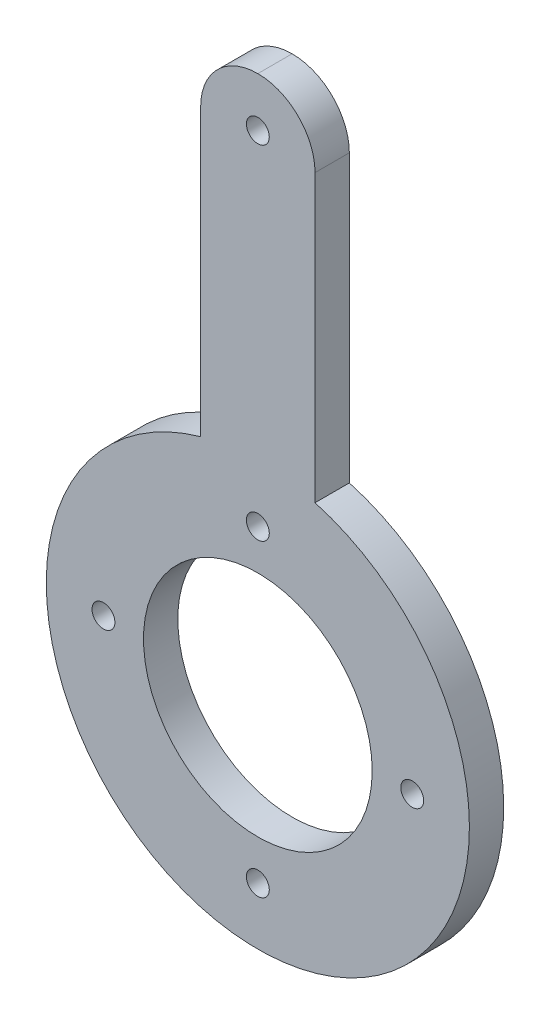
ISO-10303-21;
HEADER;
FILE_DESCRIPTION(('STEP AP214'),'2;1');
FILE_NAME('part.step','',(''),(''),'','','');
FILE_SCHEMA(('AUTOMOTIVE_DESIGN { 1 0 10303 214 1 1 1 1 }'));
ENDSEC;
DATA;
#1=APPLICATION_CONTEXT('core data for automotive mechanical design processes');
#2=APPLICATION_PROTOCOL_DEFINITION('international standard','automotive_design',2000,#1);
#3=PRODUCT_CONTEXT('',#1,'mechanical');
#4=PRODUCT('Part','Part','',(#3));
#5=PRODUCT_RELATED_PRODUCT_CATEGORY('part','',(#4));
#6=PRODUCT_DEFINITION_FORMATION('','',#4);
#7=PRODUCT_DEFINITION_CONTEXT('part definition',#1,'design');
#8=PRODUCT_DEFINITION('design','',#6,#7);
#9=PRODUCT_DEFINITION_SHAPE('','',#8);
#10=(LENGTH_UNIT() NAMED_UNIT(*) SI_UNIT(.MILLI.,.METRE.));
#11=(NAMED_UNIT(*) PLANE_ANGLE_UNIT() SI_UNIT($,.RADIAN.));
#12=(NAMED_UNIT(*) SI_UNIT($,.STERADIAN.) SOLID_ANGLE_UNIT());
#13=UNCERTAINTY_MEASURE_WITH_UNIT(LENGTH_MEASURE(1.E-05),#10,'distance_accuracy_value','');
#14=(GEOMETRIC_REPRESENTATION_CONTEXT(3) GLOBAL_UNCERTAINTY_ASSIGNED_CONTEXT((#13)) GLOBAL_UNIT_ASSIGNED_CONTEXT((#10,
#11,#12)) REPRESENTATION_CONTEXT('',''));
#15=CARTESIAN_POINT('',(0.,0.,0.));
#16=DIRECTION('',(0.,0.,1.));
#17=DIRECTION('',(1.,0.,0.));
#18=AXIS2_PLACEMENT_3D('',#15,#16,#17);
#19=CARTESIAN_POINT('',(0.,0.,3.));
#20=DIRECTION('',(0.,0.,1.));
#21=DIRECTION('',(1.,0.,0.));
#22=AXIS2_PLACEMENT_3D('',#19,#20,#21);
#23=PLANE('',#22);
#24=CARTESIAN_POINT('',(-13.4999999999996,-3.83693077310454E-13,3.));
#25=DIRECTION('',(0.,0.,1.));
#26=DIRECTION('',(1.,0.,0.));
#27=AXIS2_PLACEMENT_3D('',#24,#25,#26);
#28=CIRCLE('',#27,1.00000000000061);
#29=CARTESIAN_POINT('',(-12.499999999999,-3.83693077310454E-13,3.));
#30=VERTEX_POINT('',#29);
#31=EDGE_CURVE('E139',#30,#30,#28,.T.);
#32=ORIENTED_EDGE('',*,*,#31,.F.);
#33=EDGE_LOOP('',(#32));
#34=FACE_BOUND('',#33,.T.);
#35=CARTESIAN_POINT('',(13.5000000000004,3.82039804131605E-13,3.));
#36=DIRECTION('',(0.,0.,1.));
#37=DIRECTION('',(1.,0.,0.));
#38=AXIS2_PLACEMENT_3D('',#35,#36,#37);
#39=CIRCLE('',#38,1.0000000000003);
#40=CARTESIAN_POINT('',(14.5000000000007,3.82039804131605E-13,3.));
#41=VERTEX_POINT('',#40);
#42=EDGE_CURVE('E151',#41,#41,#39,.T.);
#43=ORIENTED_EDGE('',*,*,#42,.F.);
#44=EDGE_LOOP('',(#43));
#45=FACE_BOUND('',#44,.T.);
#46=CARTESIAN_POINT('',(0.,0.,3.));
#47=DIRECTION('',(0.,0.,1.));
#48=DIRECTION('',(1.,0.,0.));
#49=AXIS2_PLACEMENT_3D('',#46,#47,#48);
#50=CIRCLE('',#49,10.);
#51=CARTESIAN_POINT('',(10.,0.,3.));
#52=VERTEX_POINT('',#51);
#53=EDGE_CURVE('E120',#52,#52,#50,.T.);
#54=ORIENTED_EDGE('',*,*,#53,.F.);
#55=EDGE_LOOP('',(#54));
#56=FACE_BOUND('',#55,.T.);
#57=DIRECTION('',(0.,1.,0.));
#58=VECTOR('',#57,1.);
#59=CARTESIAN_POINT('',(5.,47.8115131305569,3.));
#60=LINE('',#59,#58);
#61=CARTESIAN_POINT('',(5.,17.8115131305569,3.));
#62=VERTEX_POINT('',#61);
#63=CARTESIAN_POINT('',(5.,42.8115131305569,3.));
#64=VERTEX_POINT('',#63);
#65=EDGE_CURVE('E91',#62,#64,#60,.T.);
#66=ORIENTED_EDGE('',*,*,#65,.T.);
#67=CARTESIAN_POINT('',(0.,42.8115131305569,3.));
#68=DIRECTION('',(0.,0.,1.));
#69=DIRECTION('',(1.,0.,0.));
#70=AXIS2_PLACEMENT_3D('',#67,#68,#69);
#71=CIRCLE('',#70,5.);
#72=CARTESIAN_POINT('',(0.,47.8115131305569,3.));
#73=VERTEX_POINT('',#72);
#74=EDGE_CURVE('E42',#64,#73,#71,.T.);
#75=ORIENTED_EDGE('',*,*,#74,.T.);
#76=CARTESIAN_POINT('',(0.,42.8115131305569,3.));
#77=DIRECTION('',(0.,0.,1.));
#78=DIRECTION('',(1.,0.,0.));
#79=AXIS2_PLACEMENT_3D('',#76,#77,#78);
#80=CIRCLE('',#79,5.);
#81=CARTESIAN_POINT('',(-5.,42.8115131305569,3.));
#82=VERTEX_POINT('',#81);
#83=EDGE_CURVE('E52',#73,#82,#80,.T.);
#84=ORIENTED_EDGE('',*,*,#83,.T.);
#85=DIRECTION('',(0.,-1.,0.));
#86=VECTOR('',#85,1.);
#87=CARTESIAN_POINT('',(-5.,47.8115131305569,3.));
#88=LINE('',#87,#86);
#89=CARTESIAN_POINT('',(-5.,17.8115131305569,3.));
#90=VERTEX_POINT('',#89);
#91=EDGE_CURVE('E74',#82,#90,#88,.T.);
#92=ORIENTED_EDGE('',*,*,#91,.T.);
#93=CARTESIAN_POINT('',(0.,0.,3.));
#94=DIRECTION('',(0.,0.,1.));
#95=DIRECTION('',(1.,0.,0.));
#96=AXIS2_PLACEMENT_3D('',#93,#94,#95);
#97=CIRCLE('',#96,18.5);
#98=EDGE_CURVE('E77',#90,#62,#97,.T.);
#99=ORIENTED_EDGE('',*,*,#98,.T.);
#100=EDGE_LOOP('',(#66,#75,#84,#92,#99));
#101=FACE_BOUND('',#100,.T.);
#102=CARTESIAN_POINT('',(0.,13.5,3.));
#103=DIRECTION('',(0.,0.,1.));
#104=DIRECTION('',(1.,0.,0.));
#105=AXIS2_PLACEMENT_3D('',#102,#103,#104);
#106=CIRCLE('',#105,1.);
#107=CARTESIAN_POINT('',(1.,13.5,3.));
#108=VERTEX_POINT('',#107);
#109=EDGE_CURVE('E157',#108,#108,#106,.T.);
#110=ORIENTED_EDGE('',*,*,#109,.F.);
#111=EDGE_LOOP('',(#110));
#112=FACE_BOUND('',#111,.T.);
#113=CARTESIAN_POINT('',(7.6407960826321E-13,-13.5,3.));
#114=DIRECTION('',(0.,0.,1.));
#115=DIRECTION('',(1.,0.,0.));
#116=AXIS2_PLACEMENT_3D('',#113,#114,#115);
#117=CIRCLE('',#116,1.00000000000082);
#118=CARTESIAN_POINT('',(1.00000000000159,-13.5,3.));
#119=VERTEX_POINT('',#118);
#120=EDGE_CURVE('E145',#119,#119,#117,.T.);
#121=ORIENTED_EDGE('',*,*,#120,.F.);
#122=EDGE_LOOP('',(#121));
#123=FACE_BOUND('',#122,.T.);
#124=CARTESIAN_POINT('',(0.,43.5,3.));
#125=DIRECTION('',(0.,0.,1.));
#126=DIRECTION('',(1.,0.,0.));
#127=AXIS2_PLACEMENT_3D('',#124,#125,#126);
#128=CIRCLE('',#127,1.);
#129=CARTESIAN_POINT('',(1.,43.5,3.));
#130=VERTEX_POINT('',#129);
#131=EDGE_CURVE('E131',#130,#130,#128,.T.);
#132=ORIENTED_EDGE('',*,*,#131,.F.);
#133=EDGE_LOOP('',(#132));
#134=FACE_BOUND('',#133,.T.);
#135=ADVANCED_FACE('F33',(#34,#45,#56,#101,#112,#123,#134),#23,.T.);
#136=CARTESIAN_POINT('',(0.,0.,0.));
#137=DIRECTION('',(0.,0.,1.));
#138=DIRECTION('',(1.,0.,0.));
#139=AXIS2_PLACEMENT_3D('',#136,#137,#138);
#140=PLANE('',#139);
#141=CARTESIAN_POINT('',(0.,42.8115131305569,0.));
#142=DIRECTION('',(0.,0.,1.));
#143=DIRECTION('',(1.,0.,0.));
#144=AXIS2_PLACEMENT_3D('',#141,#142,#143);
#145=CIRCLE('',#144,5.);
#146=CARTESIAN_POINT('',(-5.,42.8115131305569,0.));
#147=VERTEX_POINT('',#146);
#148=CARTESIAN_POINT('',(0.,47.8115131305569,0.));
#149=VERTEX_POINT('',#148);
#150=EDGE_CURVE('E97',#147,#149,#145,.F.);
#151=ORIENTED_EDGE('',*,*,#150,.T.);
#152=CARTESIAN_POINT('',(0.,42.8115131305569,0.));
#153=DIRECTION('',(0.,0.,1.));
#154=DIRECTION('',(1.,0.,0.));
#155=AXIS2_PLACEMENT_3D('',#152,#153,#154);
#156=CIRCLE('',#155,5.);
#157=CARTESIAN_POINT('',(5.,42.8115131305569,0.));
#158=VERTEX_POINT('',#157);
#159=EDGE_CURVE('E99',#149,#158,#156,.F.);
#160=ORIENTED_EDGE('',*,*,#159,.T.);
#161=DIRECTION('',(0.,1.,0.));
#162=VECTOR('',#161,1.);
#163=CARTESIAN_POINT('',(5.,47.8115131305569,0.));
#164=LINE('',#163,#162);
#165=CARTESIAN_POINT('',(5.,17.8115131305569,0.));
#166=VERTEX_POINT('',#165);
#167=EDGE_CURVE('E82',#166,#158,#164,.T.);
#168=ORIENTED_EDGE('',*,*,#167,.F.);
#169=CARTESIAN_POINT('',(0.,0.,0.));
#170=DIRECTION('',(0.,0.,1.));
#171=DIRECTION('',(1.,0.,0.));
#172=AXIS2_PLACEMENT_3D('',#169,#170,#171);
#173=CIRCLE('',#172,18.5);
#174=CARTESIAN_POINT('',(-5.,17.8115131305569,0.));
#175=VERTEX_POINT('',#174);
#176=EDGE_CURVE('E119',#175,#166,#173,.T.);
#177=ORIENTED_EDGE('',*,*,#176,.F.);
#178=DIRECTION('',(0.,-1.,0.));
#179=VECTOR('',#178,1.);
#180=CARTESIAN_POINT('',(-5.,47.8115131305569,0.));
#181=LINE('',#180,#179);
#182=EDGE_CURVE('E95',#147,#175,#181,.T.);
#183=ORIENTED_EDGE('',*,*,#182,.F.);
#184=EDGE_LOOP('',(#151,#160,#168,#177,#183));
#185=FACE_BOUND('',#184,.T.);
#186=CARTESIAN_POINT('',(0.,0.,0.));
#187=DIRECTION('',(0.,0.,1.));
#188=DIRECTION('',(1.,0.,0.));
#189=AXIS2_PLACEMENT_3D('',#186,#187,#188);
#190=CIRCLE('',#189,10.);
#191=CARTESIAN_POINT('',(10.,0.,0.));
#192=VERTEX_POINT('',#191);
#193=EDGE_CURVE('E160',#192,#192,#190,.T.);
#194=ORIENTED_EDGE('',*,*,#193,.T.);
#195=EDGE_LOOP('',(#194));
#196=FACE_BOUND('',#195,.T.);
#197=CARTESIAN_POINT('',(0.,13.5,0.));
#198=DIRECTION('',(0.,0.,1.));
#199=DIRECTION('',(1.,0.,0.));
#200=AXIS2_PLACEMENT_3D('',#197,#198,#199);
#201=CIRCLE('',#200,1.);
#202=CARTESIAN_POINT('',(1.,13.5,0.));
#203=VERTEX_POINT('',#202);
#204=EDGE_CURVE('E154',#203,#203,#201,.T.);
#205=ORIENTED_EDGE('',*,*,#204,.T.);
#206=EDGE_LOOP('',(#205));
#207=FACE_BOUND('',#206,.T.);
#208=CARTESIAN_POINT('',(13.5000000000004,3.82039804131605E-13,0.));
#209=DIRECTION('',(0.,0.,1.));
#210=DIRECTION('',(1.,0.,0.));
#211=AXIS2_PLACEMENT_3D('',#208,#209,#210);
#212=CIRCLE('',#211,1.0000000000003);
#213=CARTESIAN_POINT('',(14.5000000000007,3.82039804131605E-13,0.));
#214=VERTEX_POINT('',#213);
#215=EDGE_CURVE('E148',#214,#214,#212,.T.);
#216=ORIENTED_EDGE('',*,*,#215,.T.);
#217=EDGE_LOOP('',(#216));
#218=FACE_BOUND('',#217,.T.);
#219=CARTESIAN_POINT('',(7.6407960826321E-13,-13.5,0.));
#220=DIRECTION('',(0.,0.,1.));
#221=DIRECTION('',(1.,0.,0.));
#222=AXIS2_PLACEMENT_3D('',#219,#220,#221);
#223=CIRCLE('',#222,1.00000000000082);
#224=CARTESIAN_POINT('',(1.00000000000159,-13.5,0.));
#225=VERTEX_POINT('',#224);
#226=EDGE_CURVE('E142',#225,#225,#223,.T.);
#227=ORIENTED_EDGE('',*,*,#226,.T.);
#228=EDGE_LOOP('',(#227));
#229=FACE_BOUND('',#228,.T.);
#230=CARTESIAN_POINT('',(-13.4999999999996,-3.83693077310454E-13,0.));
#231=DIRECTION('',(0.,0.,1.));
#232=DIRECTION('',(1.,0.,0.));
#233=AXIS2_PLACEMENT_3D('',#230,#231,#232);
#234=CIRCLE('',#233,1.00000000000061);
#235=CARTESIAN_POINT('',(-12.499999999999,-3.83693077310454E-13,0.));
#236=VERTEX_POINT('',#235);
#237=EDGE_CURVE('E136',#236,#236,#234,.T.);
#238=ORIENTED_EDGE('',*,*,#237,.T.);
#239=EDGE_LOOP('',(#238));
#240=FACE_BOUND('',#239,.T.);
#241=CARTESIAN_POINT('',(0.,43.5,0.));
#242=DIRECTION('',(0.,0.,1.));
#243=DIRECTION('',(1.,0.,0.));
#244=AXIS2_PLACEMENT_3D('',#241,#242,#243);
#245=CIRCLE('',#244,1.);
#246=CARTESIAN_POINT('',(1.,43.5,0.));
#247=VERTEX_POINT('',#246);
#248=EDGE_CURVE('E129',#247,#247,#245,.T.);
#249=ORIENTED_EDGE('',*,*,#248,.T.);
#250=EDGE_LOOP('',(#249));
#251=FACE_BOUND('',#250,.T.);
#252=ADVANCED_FACE('F122',(#185,#196,#207,#218,#229,#240,#251),#140,.F.);
#253=CARTESIAN_POINT('',(-5.,47.8115131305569,3.));
#254=DIRECTION('',(1.,0.,0.));
#255=DIRECTION('',(0.,1.,0.));
#256=AXIS2_PLACEMENT_3D('',#253,#254,#255);
#257=PLANE('',#256);
#258=ORIENTED_EDGE('',*,*,#91,.F.);
#259=DIRECTION('',(0.,0.,-1.));
#260=VECTOR('',#259,1.);
#261=CARTESIAN_POINT('',(-5.,42.8115131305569,3.));
#262=LINE('',#261,#260);
#263=EDGE_CURVE('E11',#82,#147,#262,.T.);
#264=ORIENTED_EDGE('',*,*,#263,.T.);
#265=ORIENTED_EDGE('',*,*,#182,.T.);
#266=DIRECTION('',(0.,0.,-1.));
#267=VECTOR('',#266,1.);
#268=CARTESIAN_POINT('',(-5.,17.8115131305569,3.));
#269=LINE('',#268,#267);
#270=EDGE_CURVE('E87',#90,#175,#269,.T.);
#271=ORIENTED_EDGE('',*,*,#270,.F.);
#272=EDGE_LOOP('',(#258,#264,#265,#271));
#273=FACE_BOUND('',#272,.T.);
#274=ADVANCED_FACE('F93',(#273),#257,.F.);
#275=CARTESIAN_POINT('',(0.,0.,3.));
#276=DIRECTION('',(0.,0.,-1.));
#277=DIRECTION('',(-1.,0.,0.));
#278=AXIS2_PLACEMENT_3D('',#275,#276,#277);
#279=CYLINDRICAL_SURFACE('',#278,18.5);
#280=ORIENTED_EDGE('',*,*,#176,.T.);
#281=DIRECTION('',(0.,0.,-1.));
#282=VECTOR('',#281,1.);
#283=CARTESIAN_POINT('',(5.,17.8115131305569,3.));
#284=LINE('',#283,#282);
#285=EDGE_CURVE('E89',#62,#166,#284,.T.);
#286=ORIENTED_EDGE('',*,*,#285,.F.);
#287=ORIENTED_EDGE('',*,*,#98,.F.);
#288=ORIENTED_EDGE('',*,*,#270,.T.);
#289=EDGE_LOOP('',(#280,#286,#287,#288));
#290=FACE_BOUND('',#289,.T.);
#291=ADVANCED_FACE('F86',(#290),#279,.T.);
#292=CARTESIAN_POINT('',(5.,47.8115131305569,3.));
#293=DIRECTION('',(-1.,0.,0.));
#294=DIRECTION('',(0.,-1.,0.));
#295=AXIS2_PLACEMENT_3D('',#292,#293,#294);
#296=PLANE('',#295);
#297=ORIENTED_EDGE('',*,*,#167,.T.);
#298=DIRECTION('',(0.,0.,-1.));
#299=VECTOR('',#298,1.);
#300=CARTESIAN_POINT('',(5.,42.8115131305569,3.));
#301=LINE('',#300,#299);
#302=EDGE_CURVE('E105',#158,#64,#301,.F.);
#303=ORIENTED_EDGE('',*,*,#302,.T.);
#304=ORIENTED_EDGE('',*,*,#65,.F.);
#305=ORIENTED_EDGE('',*,*,#285,.T.);
#306=EDGE_LOOP('',(#297,#303,#304,#305));
#307=FACE_BOUND('',#306,.T.);
#308=ADVANCED_FACE('F112',(#307),#296,.F.);
#309=CARTESIAN_POINT('',(0.,0.,3.));
#310=DIRECTION('',(0.,0.,-1.));
#311=DIRECTION('',(-1.,0.,0.));
#312=AXIS2_PLACEMENT_3D('',#309,#310,#311);
#313=CYLINDRICAL_SURFACE('',#312,10.);
#314=ORIENTED_EDGE('',*,*,#53,.T.);
#315=EDGE_LOOP('',(#314));
#316=FACE_BOUND('',#315,.T.);
#317=ORIENTED_EDGE('',*,*,#193,.F.);
#318=EDGE_LOOP('',(#317));
#319=FACE_BOUND('',#318,.T.);
#320=ADVANCED_FACE('F169',(#316,#319),#313,.F.);
#321=CARTESIAN_POINT('',(0.,13.5,3.));
#322=DIRECTION('',(0.,0.,-1.));
#323=DIRECTION('',(-1.,0.,0.));
#324=AXIS2_PLACEMENT_3D('',#321,#322,#323);
#325=CYLINDRICAL_SURFACE('',#324,1.);
#326=ORIENTED_EDGE('',*,*,#109,.T.);
#327=EDGE_LOOP('',(#326));
#328=FACE_BOUND('',#327,.T.);
#329=ORIENTED_EDGE('',*,*,#204,.F.);
#330=EDGE_LOOP('',(#329));
#331=FACE_BOUND('',#330,.T.);
#332=ADVANCED_FACE('F171',(#328,#331),#325,.F.);
#333=CARTESIAN_POINT('',(13.5000000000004,3.82039804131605E-13,3.));
#334=DIRECTION('',(0.,0.,-1.));
#335=DIRECTION('',(-1.,0.,0.));
#336=AXIS2_PLACEMENT_3D('',#333,#334,#335);
#337=CYLINDRICAL_SURFACE('',#336,1.0000000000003);
#338=ORIENTED_EDGE('',*,*,#42,.T.);
#339=EDGE_LOOP('',(#338));
#340=FACE_BOUND('',#339,.T.);
#341=ORIENTED_EDGE('',*,*,#215,.F.);
#342=EDGE_LOOP('',(#341));
#343=FACE_BOUND('',#342,.T.);
#344=ADVANCED_FACE('F178',(#340,#343),#337,.F.);
#345=CARTESIAN_POINT('',(7.6407960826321E-13,-13.5,3.));
#346=DIRECTION('',(0.,0.,-1.));
#347=DIRECTION('',(-1.,0.,0.));
#348=AXIS2_PLACEMENT_3D('',#345,#346,#347);
#349=CYLINDRICAL_SURFACE('',#348,1.00000000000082);
#350=ORIENTED_EDGE('',*,*,#120,.T.);
#351=EDGE_LOOP('',(#350));
#352=FACE_BOUND('',#351,.T.);
#353=ORIENTED_EDGE('',*,*,#226,.F.);
#354=EDGE_LOOP('',(#353));
#355=FACE_BOUND('',#354,.T.);
#356=ADVANCED_FACE('F209',(#352,#355),#349,.F.);
#357=CARTESIAN_POINT('',(-13.4999999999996,-3.83693077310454E-13,3.));
#358=DIRECTION('',(0.,0.,-1.));
#359=DIRECTION('',(-1.,0.,0.));
#360=AXIS2_PLACEMENT_3D('',#357,#358,#359);
#361=CYLINDRICAL_SURFACE('',#360,1.00000000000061);
#362=ORIENTED_EDGE('',*,*,#31,.T.);
#363=EDGE_LOOP('',(#362));
#364=FACE_BOUND('',#363,.T.);
#365=ORIENTED_EDGE('',*,*,#237,.F.);
#366=EDGE_LOOP('',(#365));
#367=FACE_BOUND('',#366,.T.);
#368=ADVANCED_FACE('F203',(#364,#367),#361,.F.);
#369=CARTESIAN_POINT('',(0.,43.5,3.));
#370=DIRECTION('',(0.,0.,-1.));
#371=DIRECTION('',(-1.,0.,0.));
#372=AXIS2_PLACEMENT_3D('',#369,#370,#371);
#373=CYLINDRICAL_SURFACE('',#372,1.);
#374=ORIENTED_EDGE('',*,*,#131,.T.);
#375=EDGE_LOOP('',(#374));
#376=FACE_BOUND('',#375,.T.);
#377=ORIENTED_EDGE('',*,*,#248,.F.);
#378=EDGE_LOOP('',(#377));
#379=FACE_BOUND('',#378,.T.);
#380=ADVANCED_FACE('F199',(#376,#379),#373,.F.);
#381=CARTESIAN_POINT('',(0.,42.8115131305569,3.));
#382=DIRECTION('',(0.,0.,-1.));
#383=DIRECTION('',(-1.,0.,0.));
#384=AXIS2_PLACEMENT_3D('',#381,#382,#383);
#385=CYLINDRICAL_SURFACE('',#384,5.);
#386=ORIENTED_EDGE('',*,*,#263,.F.);
#387=ORIENTED_EDGE('',*,*,#83,.F.);
#388=DIRECTION('',(0.,0.,-1.));
#389=VECTOR('',#388,1.);
#390=CARTESIAN_POINT('',(0.,47.8115131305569,3.));
#391=LINE('',#390,#389);
#392=EDGE_CURVE('E37',#149,#73,#391,.F.);
#393=ORIENTED_EDGE('',*,*,#392,.F.);
#394=ORIENTED_EDGE('',*,*,#150,.F.);
#395=EDGE_LOOP('',(#386,#387,#393,#394));
#396=FACE_BOUND('',#395,.T.);
#397=ADVANCED_FACE('F35',(#396),#385,.T.);
#398=CARTESIAN_POINT('',(0.,42.8115131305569,3.));
#399=DIRECTION('',(0.,0.,-1.));
#400=DIRECTION('',(-1.,0.,0.));
#401=AXIS2_PLACEMENT_3D('',#398,#399,#400);
#402=CYLINDRICAL_SURFACE('',#401,5.);
#403=ORIENTED_EDGE('',*,*,#74,.F.);
#404=ORIENTED_EDGE('',*,*,#302,.F.);
#405=ORIENTED_EDGE('',*,*,#159,.F.);
#406=ORIENTED_EDGE('',*,*,#392,.T.);
#407=EDGE_LOOP('',(#403,#404,#405,#406));
#408=FACE_BOUND('',#407,.T.);
#409=ADVANCED_FACE('F127',(#408),#402,.T.);
#410=CLOSED_SHELL('',(#135,#252,#274,#291,#308,#320,#332,#344,#356,#368,#380,#397,#409));
#411=MANIFOLD_SOLID_BREP('B2',#410);
#412=ADVANCED_BREP_SHAPE_REPRESENTATION('',(#18,#411),#14);
#413=SHAPE_DEFINITION_REPRESENTATION(#9,#412);
ENDSEC;
END-ISO-10303-21;
